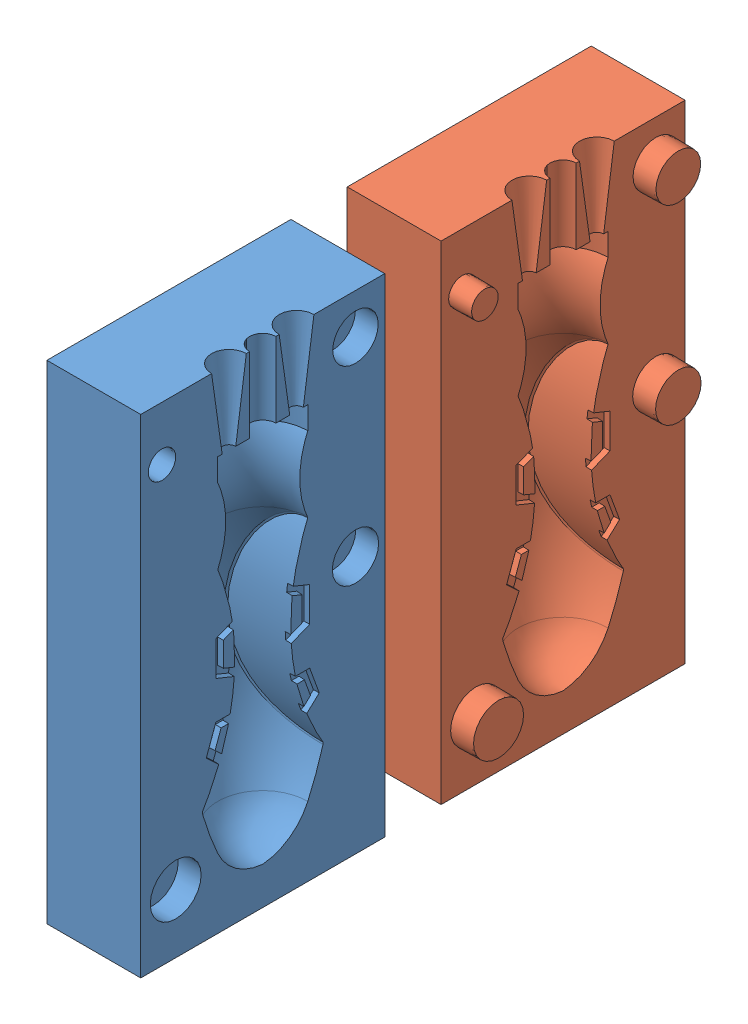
SolidWorks assembly MoldA.SLDASM, configuration Default (file format 11000). Lengths in mm.
Overall size (31 130 145).
2 component instances, 2 part files, 3 mates.
Components (placement in the parent):
- MoldA.2-1: MoldA.2.SLDPRT [Default] at (1.7238 22.3965 123.004) size (25 130 65)
- MoldA.1-1: MoldA.1.SLDPRT [Default] at (1.7238 22.3965 43.004) x (-1 0 0) z (0 0 -1) size (31 130 65)
Mates (geometry in assembly coordinates):
- Coincident1: coincident: plane of MoldA.2-1 through (-23.2762 22.3965 123.004) normal (-1 0 0); plane of MoldA.1-1 through (-23.2762 22.3965 38.4196) normal (-1 0 0)
- Coincident2: coincident: plane of MoldA.2-1 through (-23.2762 12.3965 155.504) normal (0 -1 0); plane of MoldA.1-1 through (-23.2762 12.3965 5.9196) normal (0 -1 0)
- Distance1: distance = 15 mm: plane of MoldA.2-1 through (-23.2762 142.3965 90.504) normal (0 0 -1); plane of MoldA.1-1 through (-23.2762 142.3965 75.504) normal (0 0 1)
